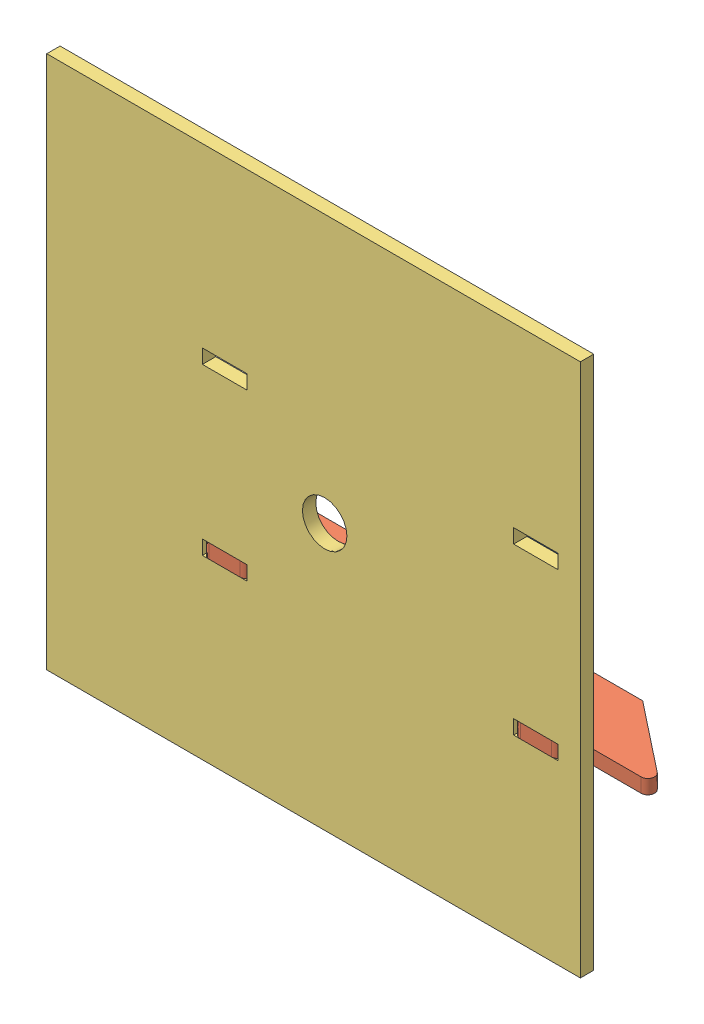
SolidWorks assembly Assemblage_mesure.SLDASM, configuration Défaut (file format 12000). Lengths in mm.
Overall size (135 120 24).
3 component instances, 3 part files, 6 mates.
Components (placement in the parent):
- cale_j_mesure_base-1: cale_j_mesure_base.SLDPRT [Défaut] at origin size (73.19 50 3)
- cale_j_mesure-1: cale_j_mesure.SLDPRT [Défaut] at (12.5 -16.8 3) x (1 0 0) z (0 -1 0) size (120 24 3.2)
- cale_j_mesure_supbouteille-1: cale_j_mesure_supbouteille.SLDPRT [Défaut] at (29.0994 0.2 21) x (-1 0 0) z (0 0 -1) size (120 120 3)
Mates (geometry in assembly coordinates):
- Coïncidente1: coincident anti-aligned: plane of cale_j_mesure_base-1 through (-1.5 -20 3) normal (0 1 0); plane of cale_j_mesure-1 through (12.5 -20 3) normal (0 -1 0)
- Coïncidente2: coincident anti-aligned: plane of cale_j_mesure_base-1 through (0 0 3) normal (0 0 1); plane of cale_j_mesure-1 through (-28.5 -20 3) normal (0 0 -1)
- Coïncidente3: coincident anti-aligned: plane of cale_j_mesure_base-1 through (26.5 -20 3) normal (-1 0 0); plane of cale_j_mesure-1 through (26.5 -20 3) normal (1 0 0)
- Coïncidente4: coincident anti-aligned: plane of cale_j_mesure-1 through (52.5 -20 18) normal (1 0 0); plane of cale_j_mesure_supbouteille-1 through (52.5 -20 18) normal (-1 0 0)
- Coïncidente5: coincident anti-aligned: plane of cale_j_mesure-1 through (12.5 -20 3) normal (0 -1 0); plane of cale_j_mesure_supbouteille-1 through (42.5 -20 18) normal (0 1 0)
- Coïncidente6: coincident anti-aligned: plane of cale_j_mesure-1 through (72.5 -20 18) normal (0 0 1); plane of cale_j_mesure_supbouteille-1 through (29.0994 0.2 18) normal (0 0 -1)
